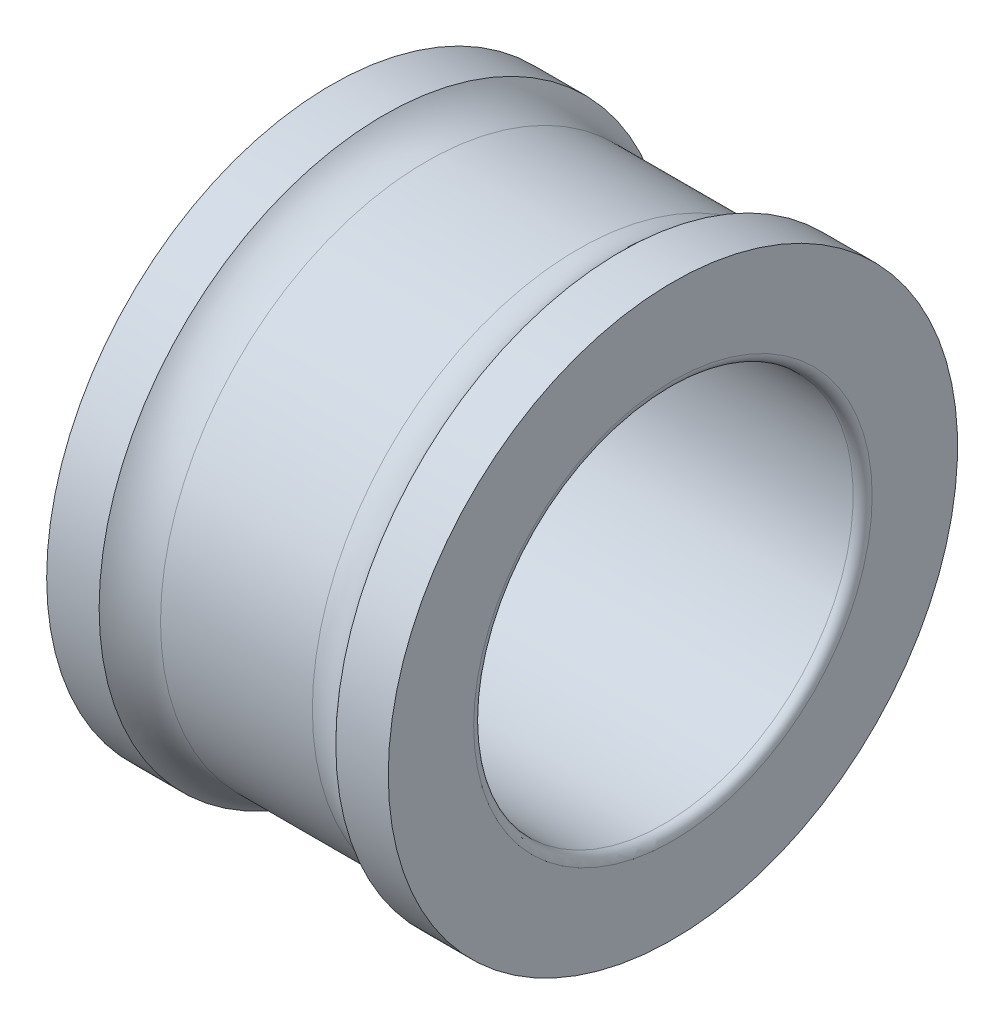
from build123d import *

# Parameters (mm, degrees)
CONG_1_R = 0.5


with BuildPart() as part:
    # Esquisse1 → R_volution1 (revolve)
    with BuildSketch(Plane.XY, mode=Mode.PRIVATE) as r_volution1_sk:
        with BuildLine():
            Line((0, 10), (0, 15))
            Line((0, 15), (2.763932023, 15))
            ThreePointArc((2.763932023, 15), (3.775255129, 14.261387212), (5, 14))
            Line((5, 14), (13, 14))
            ThreePointArc((13, 14), (14.224744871, 14.261387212), (15.236067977, 15))
            Line((15.236067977, 15), (18, 15))
            Line((18, 15), (18, 10))
            Line((18, 10), (0, 10))
        make_face()
    revolve(r_volution1_sk.sketch.rotate(Axis((-2.377411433, 0, 0), (1, 0, 0)), 90), axis=Axis((-2.377411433, 0, 0), (1, 0, 0)))

    # Cong_1
    cong_1_edges = [part.edges().sort_by_distance(p)[0] for p in [
        (0, 0, -10),
        (18, 0, -10),
    ]]
    fillet(cong_1_edges, radius=CONG_1_R)


solid = part.part
